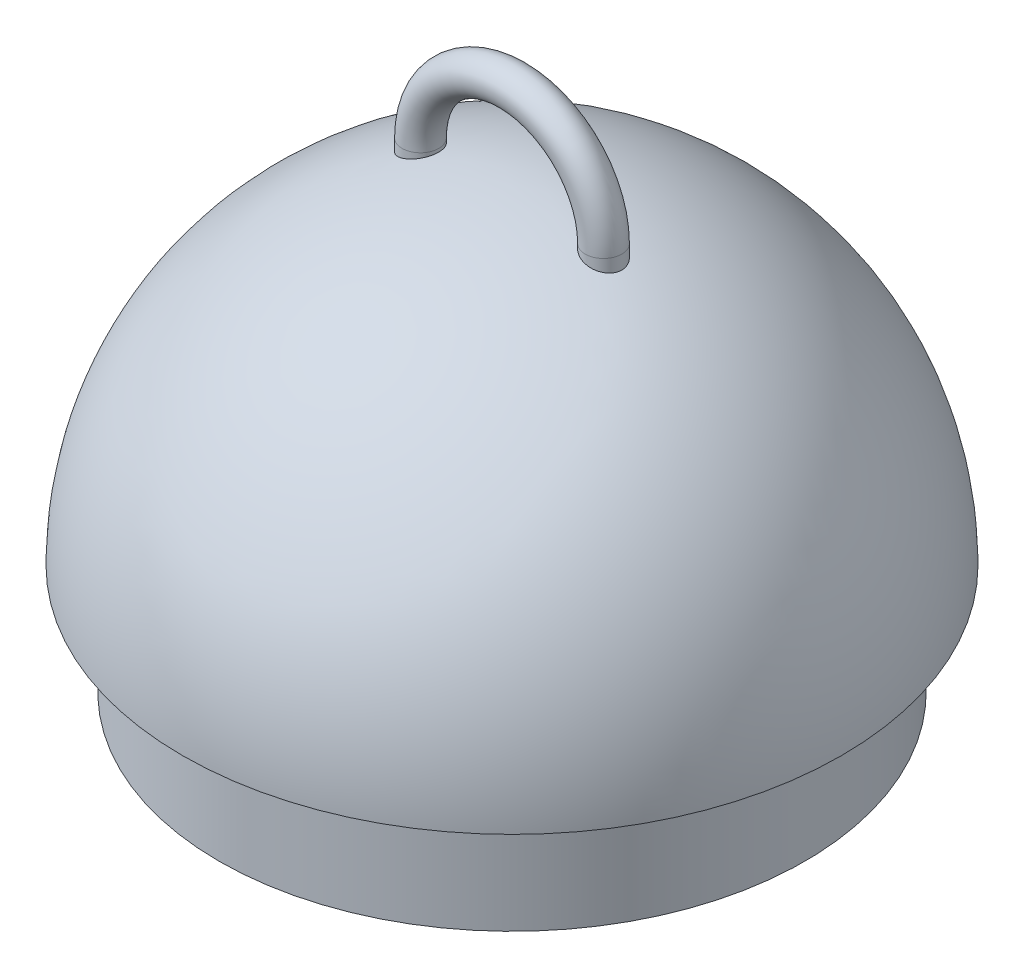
from build123d import *

# Parameters (mm, degrees)
SKETCH1_R          = 80
CASE_MATE_DEPTH    = 30
CIRCULAR_CAP_ANGLE = 180
SKETCH3_R          = 5
RING_BASE_DEPTH    = 118.618
SKETCH4_R          = 5
RING_REVOLVE_ANGLE = 180


with BuildPart() as part:
    # Sketch1 → Case Mate (new body)
    with BuildSketch(Plane(origin=(0, 0, 0), x_dir=(1, 0, 0), z_dir=(0, 1, 0))):
        with Locations(Location((0, 0, 0), (0, 0, 270))):
            Circle(SKETCH1_R)
    extrude(amount=CASE_MATE_DEPTH)

    # Sketch2 → Circular Cap (revolve)
    with BuildSketch(Plane(origin=(0, 30, 0), x_dir=(1, 0, 0), z_dir=(0, 1, 0))):
        with BuildLine():
            Line((90, 0), (-90, 0))
            ThreePointArc((-90, 0), (0, 90), (90, 0))
        make_face()
    revolve(axis=Axis((90, 30, 0), (1, 0, 0)), revolution_arc=CIRCULAR_CAP_ANGLE)

    # Sketch3 → Ring Base (add)
    with BuildSketch(Plane(origin=(0, 0, 0), x_dir=(-1, 0, 0), z_dir=(0, -1, 0))):
        with Locations(Location((25, 0, 0), (0, 0, 90))):
            Circle(SKETCH3_R)
        with Locations(Location((-25, 0, 0), (0, 0, 90))):
            Circle(SKETCH3_R)
    extrude(amount=-RING_BASE_DEPTH)

    # Sketch4 → Ring Revolve (revolve)
    with BuildSketch(Plane(origin=(0, 118.618, 0), x_dir=(1, 0, 0), z_dir=(0, 1, 0))):
        with Locations(Location((-25, 0, 0), (0, 0, 136.786781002))):
            Circle(SKETCH4_R)
    revolve(axis=Axis((0, 118.618, 0), (0, 0, -1)), revolution_arc=RING_REVOLVE_ANGLE)


solid = part.part
